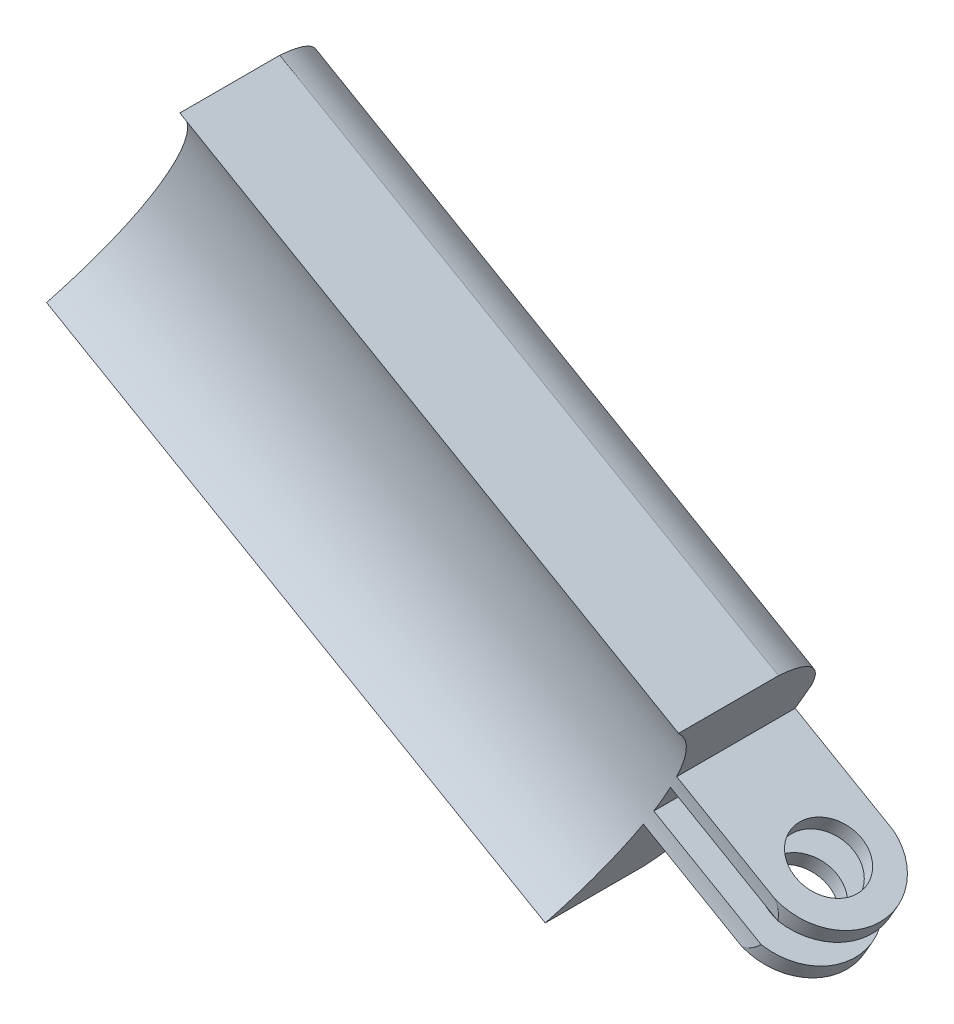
from build123d import *

# Parameters (mm, degrees)
EXTRUDE_1_DEPTH          = 10
CUT_EXTRUDE_1_DEPTH      = 40
CUT_EXTRUDE_2_DEPTH      = 48.087206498
CUT_EXTRUDE_2_DEPTH_BACK = 40
EXTRUDE_START            = 10
EXTRUDE_2_DEPTH          = 10
CUT_EXTRUDE_3_DEPTH      = 10
SKETCH_6_R               = 2
CUT_EXTRUDE_4_DEPTH      = 10


with BuildPart() as part:
    # Sketch 1 → Extrude 1 (new body)
    with BuildSketch(Plane.XY):
        Polygon((-43.040593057, 51.461524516), (-13.105012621, 34.178209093), (-21.105012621, 20.321802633), (-51.040593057, 37.605118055), align=None)
    extrude(amount=EXTRUDE_1_DEPTH)

    # Sketch 2 → Cut-Extrude 1 (cut)
    with BuildSketch(Plane(origin=(-54.563938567, 31.502504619, 0), x_dir=(0, 0, 1), z_dir=(-0.8660254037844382, 0.5000000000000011, 0))):
        with BuildLine():
            Line((0, 19.04669102), (0, 11.04669102))
            ThreePointArc((0, 11.04669102), (1.379942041, 8.426633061), (4, 7.04669102))
            Line((4, 7.04669102), (4, 1.323379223))
            Line((4, 1.323379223), (-13.602711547, 1.323379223))
            Line((-13.602711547, 1.323379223), (-13.602711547, 32.168156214))
            Line((-13.602711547, 32.168156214), (4, 32.168156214))
            Line((4, 32.168156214), (4, 23.04669102))
            ThreePointArc((4, 23.04669102), (1.379942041, 21.666748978), (0, 19.04669102))
        make_face()
    extrude(amount=-CUT_EXTRUDE_1_DEPTH, mode=Mode.SUBTRACT)

    # Sketch 3 → Cut-Extrude 2 (cut, two sides: drawn at the far end of the back side and taken through both)
    with BuildSketch(Plane(origin=(-54.563938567, 31.502504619, 0), x_dir=(0, 0, 1), z_dir=(-0.8660254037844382, 0.5000000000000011, 0)).offset(-CUT_EXTRUDE_2_DEPTH_BACK)):
        with BuildLine():
            Line((60.056456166, 79.01151037), (10, 23.04669102))
            ThreePointArc((10, 23.04669102), (6.94427191, 15.04669102), (10, 7.04669102))
            Line((10, 7.04669102), (60.056456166, -48.91812833))
            Line((60.056456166, -48.91812833), (210.225824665, -48.91812833))
            Line((210.225824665, -48.91812833), (210.225824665, 79.01151037))
            Line((210.225824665, 79.01151037), (60.056456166, 79.01151037))
        make_face()
    extrude(amount=CUT_EXTRUDE_2_DEPTH + CUT_EXTRUDE_2_DEPTH_BACK, mode=Mode.SUBTRACT)

    # Sketch 4 → Extrude 2 (add)
    with BuildSketch(Plane(origin=(-24.628358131, 14.219189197, 0), x_dir=(0, 0, -1), z_dir=(0.8660254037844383, -0.5000000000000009, 0)).offset(EXTRUDE_START)):
        with BuildLine():
            Line((-7.112112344, 17.04669102), (0, 17.04669102))
            Line((0, 17.04669102), (0, 16.04669102))
            Line((0, 16.04669102), (-6.986011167, 16.04669102))
            ThreePointArc((-6.986011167, 16.04669102), (-7.038557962, 16.548015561), (-7.112112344, 17.04669102))
        make_face()
        with BuildLine():
            Line((-7.112112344, 13.04669102), (0, 13.04669102))
            Line((0, 13.04669102), (0, 14.04669102))
            Line((0, 14.04669102), (-6.986011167, 14.04669102))
            ThreePointArc((-6.986011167, 14.04669102), (-7.038557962, 13.545366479), (-7.112112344, 13.04669102))
        make_face()
    extrude(amount=-EXTRUDE_2_DEPTH)

    # Sketch 5 → Cut-Extrude 3 (cut)
    with BuildSketch(Plane(origin=(6.52334551, 11.298765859, 0), x_dir=(0.8660254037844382, -0.5000000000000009, 0), z_dir=(-0.5000000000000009, -0.8660254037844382, 0))):
        with BuildLine():
            Line((-21.614709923, 7.112112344), (-18.438378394, 7.112112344))
            Line((-18.438378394, 7.112112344), (-16.558054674, 7.112112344))
            Line((-16.558054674, 7.112112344), (-16.558054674, 0))
            Line((-16.558054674, 0), (-21.614709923, 0))
            ThreePointArc((-21.614709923, 0), (-18.438378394, 3.556056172), (-21.614709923, 7.112112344))
        make_face()
    extrude(amount=-CUT_EXTRUDE_3_DEPTH, mode=Mode.SUBTRACT)

    # Sketch 6 → Cut-Extrude 4 (cut)
    with BuildSketch(Plane(origin=(6.52334551, 11.298765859, 0), x_dir=(0.8660254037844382, -0.5000000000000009, 0), z_dir=(-0.5000000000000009, -0.8660254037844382, 0))):
        with Locations((-22.01713226, 3.556056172)):
            Circle(SKETCH_6_R)
    extrude(amount=-CUT_EXTRUDE_4_DEPTH, mode=Mode.SUBTRACT)


solid = part.part
